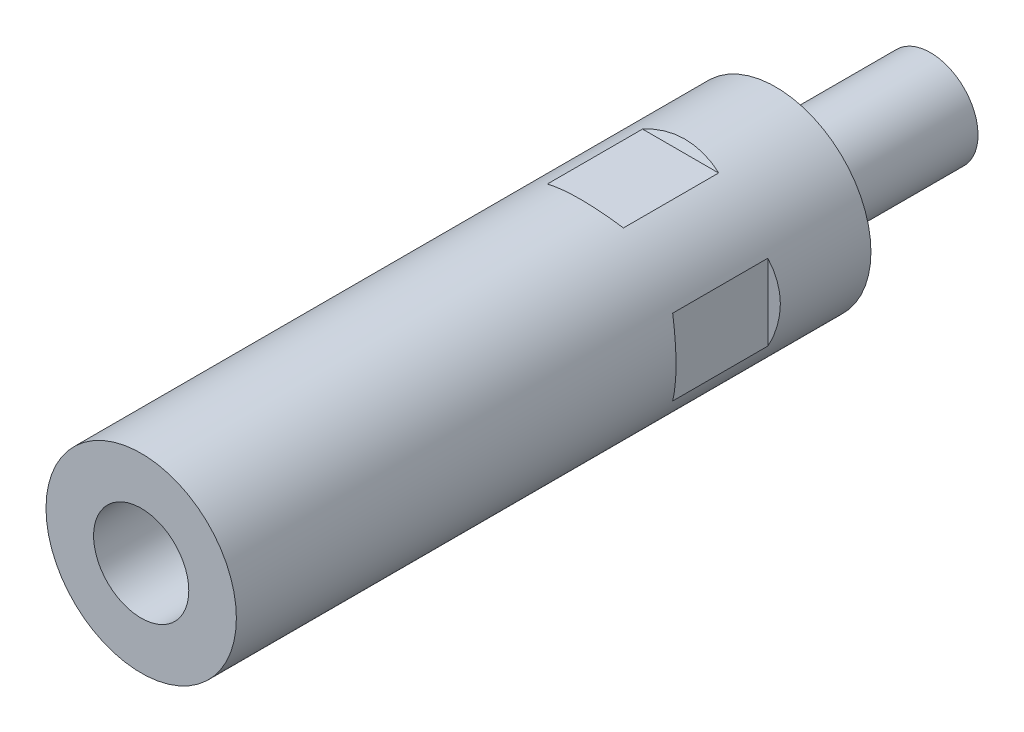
ISO-10303-21;
HEADER;
FILE_DESCRIPTION(('STEP AP214'),'2;1');
FILE_NAME('part.step','',(''),(''),'','','');
FILE_SCHEMA(('AUTOMOTIVE_DESIGN { 1 0 10303 214 1 1 1 1 }'));
ENDSEC;
DATA;
#1=APPLICATION_CONTEXT('core data for automotive mechanical design processes');
#2=APPLICATION_PROTOCOL_DEFINITION('international standard','automotive_design',2000,#1);
#3=PRODUCT_CONTEXT('',#1,'mechanical');
#4=PRODUCT('Part','Part','',(#3));
#5=PRODUCT_RELATED_PRODUCT_CATEGORY('part','',(#4));
#6=PRODUCT_DEFINITION_FORMATION('','',#4);
#7=PRODUCT_DEFINITION_CONTEXT('part definition',#1,'design');
#8=PRODUCT_DEFINITION('design','',#6,#7);
#9=PRODUCT_DEFINITION_SHAPE('','',#8);
#10=(LENGTH_UNIT() NAMED_UNIT(*) SI_UNIT(.MILLI.,.METRE.));
#11=(NAMED_UNIT(*) PLANE_ANGLE_UNIT() SI_UNIT($,.RADIAN.));
#12=(NAMED_UNIT(*) SI_UNIT($,.STERADIAN.) SOLID_ANGLE_UNIT());
#13=UNCERTAINTY_MEASURE_WITH_UNIT(LENGTH_MEASURE(1.E-05),#10,'distance_accuracy_value','');
#14=(GEOMETRIC_REPRESENTATION_CONTEXT(3) GLOBAL_UNCERTAINTY_ASSIGNED_CONTEXT((#13)) GLOBAL_UNIT_ASSIGNED_CONTEXT((#10,
#11,#12)) REPRESENTATION_CONTEXT('',''));
#15=CARTESIAN_POINT('',(0.,0.,0.));
#16=DIRECTION('',(0.,0.,1.));
#17=DIRECTION('',(1.,0.,0.));
#18=AXIS2_PLACEMENT_3D('',#15,#16,#17);
#19=CARTESIAN_POINT('',(0.,0.,0.5));
#20=DIRECTION('',(0.,0.,1.));
#21=DIRECTION('',(0.,-1.,0.));
#22=AXIS2_PLACEMENT_3D('',#19,#20,#21);
#23=CYLINDRICAL_SURFACE('',#22,6.);
#24=CARTESIAN_POINT('',(0.,0.,-19.5));
#25=DIRECTION('',(0.,0.,1.));
#26=DIRECTION('',(0.,-1.,0.));
#27=AXIS2_PLACEMENT_3D('',#24,#25,#26);
#28=CIRCLE('',#27,6.);
#29=CARTESIAN_POINT('',(0.,-6.,-19.5));
#30=VERTEX_POINT('',#29);
#31=EDGE_CURVE('E22',#30,#30,#28,.F.);
#32=ORIENTED_EDGE('',*,*,#31,.F.);
#33=EDGE_LOOP('',(#32));
#34=FACE_BOUND('',#33,.T.);
#35=CARTESIAN_POINT('',(0.,0.,0.));
#36=DIRECTION('',(0.,0.,1.));
#37=DIRECTION('',(1.,0.,0.));
#38=AXIS2_PLACEMENT_3D('',#35,#36,#37);
#39=CIRCLE('',#38,6.);
#40=CARTESIAN_POINT('',(6.,0.,0.));
#41=VERTEX_POINT('',#40);
#42=EDGE_CURVE('E9',#41,#41,#39,.T.);
#43=ORIENTED_EDGE('',*,*,#42,.F.);
#44=EDGE_LOOP('',(#43));
#45=FACE_BOUND('',#44,.T.);
#46=ADVANCED_FACE('F14',(#34,#45),#23,.T.);
#47=CARTESIAN_POINT('',(0.,0.,-19.5));
#48=DIRECTION('',(0.,0.,1.));
#49=DIRECTION('',(0.,-1.,0.));
#50=AXIS2_PLACEMENT_3D('',#47,#48,#49);
#51=PLANE('',#50);
#52=ORIENTED_EDGE('',*,*,#31,.T.);
#53=EDGE_LOOP('',(#52));
#54=FACE_BOUND('',#53,.T.);
#55=ADVANCED_FACE('F16',(#54),#51,.F.);
#56=CARTESIAN_POINT('',(5.1,0.,50.));
#57=DIRECTION('',(0.,0.,-1.));
#58=DIRECTION('',(-1.,0.,0.));
#59=AXIS2_PLACEMENT_3D('',#56,#57,#58);
#60=PLANE('',#59);
#61=CARTESIAN_POINT('',(0.,0.,50.));
#62=DIRECTION('',(0.,0.,1.));
#63=DIRECTION('',(1.,0.,0.));
#64=AXIS2_PLACEMENT_3D('',#61,#62,#63);
#65=CIRCLE('',#64,6.);
#66=CARTESIAN_POINT('',(6.,0.,50.));
#67=VERTEX_POINT('',#66);
#68=EDGE_CURVE('E251',#67,#67,#65,.T.);
#69=ORIENTED_EDGE('',*,*,#68,.T.);
#70=EDGE_LOOP('',(#69));
#71=FACE_BOUND('',#70,.T.);
#72=ADVANCED_FACE('F125',(#71),#60,.F.);
#73=CARTESIAN_POINT('',(0.,0.,80.));
#74=DIRECTION('',(0.,0.,1.));
#75=DIRECTION('',(1.,0.,0.));
#76=AXIS2_PLACEMENT_3D('',#73,#74,#75);
#77=CYLINDRICAL_SURFACE('',#76,6.);
#78=ORIENTED_EDGE('',*,*,#68,.F.);
#79=EDGE_LOOP('',(#78));
#80=FACE_BOUND('',#79,.T.);
#81=CARTESIAN_POINT('',(0.,0.,80.));
#82=DIRECTION('',(0.,0.,1.));
#83=DIRECTION('',(1.,0.,0.));
#84=AXIS2_PLACEMENT_3D('',#81,#82,#83);
#85=CIRCLE('',#84,6.);
#86=CARTESIAN_POINT('',(6.,0.,80.));
#87=VERTEX_POINT('',#86);
#88=EDGE_CURVE('E96',#87,#87,#85,.T.);
#89=ORIENTED_EDGE('',*,*,#88,.T.);
#90=EDGE_LOOP('',(#89));
#91=FACE_BOUND('',#90,.T.);
#92=ADVANCED_FACE('F127',(#80,#91),#77,.F.);
#93=CARTESIAN_POINT('',(0.,0.,80.));
#94=DIRECTION('',(0.,0.,1.));
#95=DIRECTION('',(1.,0.,0.));
#96=AXIS2_PLACEMENT_3D('',#93,#94,#95);
#97=PLANE('',#96);
#98=ORIENTED_EDGE('',*,*,#88,.F.);
#99=EDGE_LOOP('',(#98));
#100=FACE_BOUND('',#99,.T.);
#101=CARTESIAN_POINT('',(0.,0.,80.));
#102=DIRECTION('',(0.,0.,1.));
#103=DIRECTION('',(1.,0.,0.));
#104=AXIS2_PLACEMENT_3D('',#101,#102,#103);
#105=CIRCLE('',#104,12.);
#106=CARTESIAN_POINT('',(12.,0.,80.));
#107=VERTEX_POINT('',#106);
#108=EDGE_CURVE('E239',#107,#107,#105,.T.);
#109=ORIENTED_EDGE('',*,*,#108,.T.);
#110=EDGE_LOOP('',(#109));
#111=FACE_BOUND('',#110,.T.);
#112=ADVANCED_FACE('F134',(#100,#111),#97,.T.);
#113=CARTESIAN_POINT('',(11.,-12.,24.));
#114=DIRECTION('',(-0.5,0.,0.866025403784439));
#115=DIRECTION('',(0.866025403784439,0.,0.5));
#116=AXIS2_PLACEMENT_3D('',#113,#114,#115);
#117=PLANE('',#116);
#118=DIRECTION('',(0.,1.,0.));
#119=VECTOR('',#118,1.);
#120=CARTESIAN_POINT('',(11.,-12.,24.));
#121=LINE('',#120,#119);
#122=CARTESIAN_POINT('',(11.,-4.79583152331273,24.));
#123=VERTEX_POINT('',#122);
#124=CARTESIAN_POINT('',(11.,4.79583152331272,24.));
#125=VERTEX_POINT('',#124);
#126=EDGE_CURVE('E183',#123,#125,#121,.T.);
#127=ORIENTED_EDGE('',*,*,#126,.T.);
#128=CARTESIAN_POINT('',(0.,0.,17.6491470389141));
#129=DIRECTION('',(-0.5,0.,0.866025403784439));
#130=DIRECTION('',(-0.866025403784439,0.,-0.5));
#131=AXIS2_PLACEMENT_3D('',#128,#129,#130);
#132=ELLIPSE('',#131,13.856406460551,12.);
#133=EDGE_CURVE('E35',#123,#125,#132,.T.);
#134=ORIENTED_EDGE('',*,*,#133,.F.);
#135=EDGE_LOOP('',(#127,#134));
#136=FACE_BOUND('',#135,.T.);
#137=ADVANCED_FACE('F175',(#136),#117,.F.);
#138=CARTESIAN_POINT('',(11.,-12.,24.));
#139=DIRECTION('',(-1.,0.,0.));
#140=DIRECTION('',(0.,0.,1.));
#141=AXIS2_PLACEMENT_3D('',#138,#139,#140);
#142=PLANE('',#141);
#143=ORIENTED_EDGE('',*,*,#126,.F.);
#144=DIRECTION('',(0.,0.,-1.));
#145=VECTOR('',#144,1.);
#146=CARTESIAN_POINT('',(11.,-4.79583152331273,80.));
#147=LINE('',#146,#145);
#148=CARTESIAN_POINT('',(11.,-4.79583152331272,12.));
#149=VERTEX_POINT('',#148);
#150=EDGE_CURVE('E191',#149,#123,#147,.F.);
#151=ORIENTED_EDGE('',*,*,#150,.F.);
#152=DIRECTION('',(0.,1.,0.));
#153=VECTOR('',#152,1.);
#154=CARTESIAN_POINT('',(11.,-12.,12.));
#155=LINE('',#154,#153);
#156=CARTESIAN_POINT('',(11.,4.79583152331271,12.));
#157=VERTEX_POINT('',#156);
#158=EDGE_CURVE('E187',#149,#157,#155,.T.);
#159=ORIENTED_EDGE('',*,*,#158,.T.);
#160=DIRECTION('',(0.,0.,-1.));
#161=VECTOR('',#160,1.);
#162=CARTESIAN_POINT('',(11.,4.79583152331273,80.));
#163=LINE('',#162,#161);
#164=EDGE_CURVE('E29',#125,#157,#163,.T.);
#165=ORIENTED_EDGE('',*,*,#164,.F.);
#166=EDGE_LOOP('',(#143,#151,#159,#165));
#167=FACE_BOUND('',#166,.T.);
#168=ADVANCED_FACE('F172',(#167),#142,.F.);
#169=CARTESIAN_POINT('',(11.,-12.,12.));
#170=DIRECTION('',(-0.5,0.,-0.866025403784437));
#171=DIRECTION('',(-0.866025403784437,0.,0.5));
#172=AXIS2_PLACEMENT_3D('',#169,#170,#171);
#173=PLANE('',#172);
#174=CARTESIAN_POINT('',(0.,0.,18.350852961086));
#175=DIRECTION('',(-0.5,0.,-0.866025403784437));
#176=DIRECTION('',(0.866025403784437,0.,-0.5));
#177=AXIS2_PLACEMENT_3D('',#174,#175,#176);
#178=ELLIPSE('',#177,13.856406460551,12.);
#179=EDGE_CURVE('E195',#157,#149,#178,.T.);
#180=ORIENTED_EDGE('',*,*,#179,.F.);
#181=ORIENTED_EDGE('',*,*,#158,.F.);
#182=EDGE_LOOP('',(#180,#181));
#183=FACE_BOUND('',#182,.T.);
#184=ADVANCED_FACE('F167',(#183),#173,.F.);
#185=CARTESIAN_POINT('',(-11.,-12.,12.));
#186=DIRECTION('',(0.5,0.,-0.866025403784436));
#187=DIRECTION('',(-0.866025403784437,0.,-0.5));
#188=AXIS2_PLACEMENT_3D('',#185,#186,#187);
#189=PLANE('',#188);
#190=CARTESIAN_POINT('',(0.,0.,18.350852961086));
#191=DIRECTION('',(0.5,0.,-0.866025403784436));
#192=DIRECTION('',(-0.866025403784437,0.,-0.5));
#193=AXIS2_PLACEMENT_3D('',#190,#191,#192);
#194=ELLIPSE('',#193,13.8564064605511,12.);
#195=CARTESIAN_POINT('',(-11.,-4.79583152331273,12.));
#196=VERTEX_POINT('',#195);
#197=CARTESIAN_POINT('',(-11.,4.79583152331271,12.));
#198=VERTEX_POINT('',#197);
#199=EDGE_CURVE('E193',#196,#198,#194,.T.);
#200=ORIENTED_EDGE('',*,*,#199,.F.);
#201=DIRECTION('',(0.,1.,0.));
#202=VECTOR('',#201,1.);
#203=CARTESIAN_POINT('',(-11.,-12.,12.));
#204=LINE('',#203,#202);
#205=EDGE_CURVE('E227',#196,#198,#204,.T.);
#206=ORIENTED_EDGE('',*,*,#205,.T.);
#207=EDGE_LOOP('',(#200,#206));
#208=FACE_BOUND('',#207,.T.);
#209=ADVANCED_FACE('F163',(#208),#189,.F.);
#210=CARTESIAN_POINT('',(-11.,-12.,24.));
#211=DIRECTION('',(0.5,0.,0.866025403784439));
#212=DIRECTION('',(0.866025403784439,0.,-0.5));
#213=AXIS2_PLACEMENT_3D('',#210,#211,#212);
#214=PLANE('',#213);
#215=DIRECTION('',(0.,1.,0.));
#216=VECTOR('',#215,1.);
#217=CARTESIAN_POINT('',(-11.,-12.,24.));
#218=LINE('',#217,#216);
#219=CARTESIAN_POINT('',(-11.,-4.79583152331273,24.));
#220=VERTEX_POINT('',#219);
#221=CARTESIAN_POINT('',(-11.,4.79583152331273,24.));
#222=VERTEX_POINT('',#221);
#223=EDGE_CURVE('E231',#220,#222,#218,.T.);
#224=ORIENTED_EDGE('',*,*,#223,.F.);
#225=CARTESIAN_POINT('',(0.,0.,17.6491470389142));
#226=DIRECTION('',(0.5,0.,0.866025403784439));
#227=DIRECTION('',(0.866025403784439,0.,-0.5));
#228=AXIS2_PLACEMENT_3D('',#225,#226,#227);
#229=ELLIPSE('',#228,13.856406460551,12.);
#230=EDGE_CURVE('E206',#222,#220,#229,.T.);
#231=ORIENTED_EDGE('',*,*,#230,.F.);
#232=EDGE_LOOP('',(#224,#231));
#233=FACE_BOUND('',#232,.T.);
#234=ADVANCED_FACE('F160',(#233),#214,.F.);
#235=CARTESIAN_POINT('',(-11.,-12.,24.));
#236=DIRECTION('',(1.,0.,0.));
#237=DIRECTION('',(0.,0.,-1.));
#238=AXIS2_PLACEMENT_3D('',#235,#236,#237);
#239=PLANE('',#238);
#240=ORIENTED_EDGE('',*,*,#223,.T.);
#241=DIRECTION('',(0.,0.,-1.));
#242=VECTOR('',#241,1.);
#243=CARTESIAN_POINT('',(-11.,4.79583152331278,80.));
#244=LINE('',#243,#242);
#245=EDGE_CURVE('E200',#198,#222,#244,.F.);
#246=ORIENTED_EDGE('',*,*,#245,.F.);
#247=ORIENTED_EDGE('',*,*,#205,.F.);
#248=DIRECTION('',(0.,0.,-1.));
#249=VECTOR('',#248,1.);
#250=CARTESIAN_POINT('',(-11.,-4.79583152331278,80.));
#251=LINE('',#250,#249);
#252=EDGE_CURVE('E203',#220,#196,#251,.T.);
#253=ORIENTED_EDGE('',*,*,#252,.F.);
#254=EDGE_LOOP('',(#240,#246,#247,#253));
#255=FACE_BOUND('',#254,.T.);
#256=ADVANCED_FACE('F158',(#255),#239,.F.);
#257=CARTESIAN_POINT('',(12.,11.,24.));
#258=DIRECTION('',(0.,-0.5,0.866025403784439));
#259=DIRECTION('',(0.,-0.866025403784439,-0.5));
#260=AXIS2_PLACEMENT_3D('',#257,#258,#259);
#261=PLANE('',#260);
#262=DIRECTION('',(-1.,0.,0.));
#263=VECTOR('',#262,1.);
#264=CARTESIAN_POINT('',(12.,11.,24.));
#265=LINE('',#264,#263);
#266=CARTESIAN_POINT('',(4.79583152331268,11.,24.));
#267=VERTEX_POINT('',#266);
#268=CARTESIAN_POINT('',(-4.79583152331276,11.,24.));
#269=VERTEX_POINT('',#268);
#270=EDGE_CURVE('E225',#267,#269,#265,.T.);
#271=ORIENTED_EDGE('',*,*,#270,.T.);
#272=CARTESIAN_POINT('',(0.,0.,17.6491470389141));
#273=DIRECTION('',(0.,-0.5,0.866025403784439));
#274=DIRECTION('',(0.,-0.866025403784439,-0.5));
#275=AXIS2_PLACEMENT_3D('',#272,#273,#274);
#276=ELLIPSE('',#275,13.856406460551,12.);
#277=EDGE_CURVE('E214',#267,#269,#276,.T.);
#278=ORIENTED_EDGE('',*,*,#277,.F.);
#279=EDGE_LOOP('',(#271,#278));
#280=FACE_BOUND('',#279,.T.);
#281=ADVANCED_FACE('F151',(#280),#261,.F.);
#282=CARTESIAN_POINT('',(12.,11.,24.));
#283=DIRECTION('',(0.,-1.,0.));
#284=DIRECTION('',(1.,0.,0.));
#285=AXIS2_PLACEMENT_3D('',#282,#283,#284);
#286=PLANE('',#285);
#287=ORIENTED_EDGE('',*,*,#270,.F.);
#288=DIRECTION('',(0.,0.,-1.));
#289=VECTOR('',#288,1.);
#290=CARTESIAN_POINT('',(4.79583152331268,11.,80.));
#291=LINE('',#290,#289);
#292=CARTESIAN_POINT('',(4.79583152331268,11.,12.));
#293=VERTEX_POINT('',#292);
#294=EDGE_CURVE('E88',#293,#267,#291,.F.);
#295=ORIENTED_EDGE('',*,*,#294,.F.);
#296=DIRECTION('',(-1.,0.,0.));
#297=VECTOR('',#296,1.);
#298=CARTESIAN_POINT('',(12.,11.,12.));
#299=LINE('',#298,#297);
#300=CARTESIAN_POINT('',(-4.79583152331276,11.,12.));
#301=VERTEX_POINT('',#300);
#302=EDGE_CURVE('E223',#293,#301,#299,.T.);
#303=ORIENTED_EDGE('',*,*,#302,.T.);
#304=DIRECTION('',(0.,0.,-1.));
#305=VECTOR('',#304,1.);
#306=CARTESIAN_POINT('',(-4.79583152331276,11.,80.));
#307=LINE('',#306,#305);
#308=EDGE_CURVE('E211',#269,#301,#307,.T.);
#309=ORIENTED_EDGE('',*,*,#308,.F.);
#310=EDGE_LOOP('',(#287,#295,#303,#309));
#311=FACE_BOUND('',#310,.T.);
#312=ADVANCED_FACE('F148',(#311),#286,.F.);
#313=CARTESIAN_POINT('',(12.,11.,12.));
#314=DIRECTION('',(0.,-0.5,-0.866025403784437));
#315=DIRECTION('',(0.,0.866025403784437,-0.5));
#316=AXIS2_PLACEMENT_3D('',#313,#314,#315);
#317=PLANE('',#316);
#318=CARTESIAN_POINT('',(0.,0.,18.350852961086));
#319=DIRECTION('',(0.,-0.5,-0.866025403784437));
#320=DIRECTION('',(0.,0.866025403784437,-0.5));
#321=AXIS2_PLACEMENT_3D('',#318,#319,#320);
#322=ELLIPSE('',#321,13.856406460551,12.);
#323=EDGE_CURVE('E209',#301,#293,#322,.T.);
#324=ORIENTED_EDGE('',*,*,#323,.F.);
#325=ORIENTED_EDGE('',*,*,#302,.F.);
#326=EDGE_LOOP('',(#324,#325));
#327=FACE_BOUND('',#326,.T.);
#328=ADVANCED_FACE('F145',(#327),#317,.F.);
#329=CARTESIAN_POINT('',(12.,-11.,12.));
#330=DIRECTION('',(0.,0.5,-0.866025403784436));
#331=DIRECTION('',(0.,0.866025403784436,0.5));
#332=AXIS2_PLACEMENT_3D('',#329,#330,#331);
#333=PLANE('',#332);
#334=CARTESIAN_POINT('',(0.,0.,18.350852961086));
#335=DIRECTION('',(0.,0.5,-0.866025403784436));
#336=DIRECTION('',(0.,-0.866025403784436,-0.5));
#337=AXIS2_PLACEMENT_3D('',#334,#335,#336);
#338=ELLIPSE('',#337,13.8564064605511,12.);
#339=CARTESIAN_POINT('',(4.79583152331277,-11.,12.));
#340=VERTEX_POINT('',#339);
#341=CARTESIAN_POINT('',(-4.79583152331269,-11.,12.));
#342=VERTEX_POINT('',#341);
#343=EDGE_CURVE('E79',#340,#342,#338,.T.);
#344=ORIENTED_EDGE('',*,*,#343,.F.);
#345=DIRECTION('',(-1.,0.,0.));
#346=VECTOR('',#345,1.);
#347=CARTESIAN_POINT('',(12.,-11.,12.));
#348=LINE('',#347,#346);
#349=EDGE_CURVE('E82',#340,#342,#348,.T.);
#350=ORIENTED_EDGE('',*,*,#349,.T.);
#351=EDGE_LOOP('',(#344,#350));
#352=FACE_BOUND('',#351,.T.);
#353=ADVANCED_FACE('F81',(#352),#333,.F.);
#354=CARTESIAN_POINT('',(12.,-11.,24.));
#355=DIRECTION('',(0.,0.5,0.866025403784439));
#356=DIRECTION('',(0.,-0.866025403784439,0.5));
#357=AXIS2_PLACEMENT_3D('',#354,#355,#356);
#358=PLANE('',#357);
#359=DIRECTION('',(-1.,0.,0.));
#360=VECTOR('',#359,1.);
#361=CARTESIAN_POINT('',(12.,-11.,24.));
#362=LINE('',#361,#360);
#363=CARTESIAN_POINT('',(4.79583152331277,-11.,24.));
#364=VERTEX_POINT('',#363);
#365=CARTESIAN_POINT('',(-4.79583152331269,-11.,24.));
#366=VERTEX_POINT('',#365);
#367=EDGE_CURVE('E95',#364,#366,#362,.T.);
#368=ORIENTED_EDGE('',*,*,#367,.F.);
#369=CARTESIAN_POINT('',(0.,0.,17.6491470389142));
#370=DIRECTION('',(0.,0.5,0.866025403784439));
#371=DIRECTION('',(0.,0.866025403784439,-0.5));
#372=AXIS2_PLACEMENT_3D('',#369,#370,#371);
#373=ELLIPSE('',#372,13.856406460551,12.);
#374=EDGE_CURVE('E101',#366,#364,#373,.T.);
#375=ORIENTED_EDGE('',*,*,#374,.F.);
#376=EDGE_LOOP('',(#368,#375));
#377=FACE_BOUND('',#376,.T.);
#378=ADVANCED_FACE('F139',(#377),#358,.F.);
#379=CARTESIAN_POINT('',(12.,-11.,24.));
#380=DIRECTION('',(0.,1.,0.));
#381=DIRECTION('',(-1.,0.,0.));
#382=AXIS2_PLACEMENT_3D('',#379,#380,#381);
#383=PLANE('',#382);
#384=ORIENTED_EDGE('',*,*,#367,.T.);
#385=DIRECTION('',(0.,0.,-1.));
#386=VECTOR('',#385,1.);
#387=CARTESIAN_POINT('',(-4.79583152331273,-11.,80.));
#388=LINE('',#387,#386);
#389=EDGE_CURVE('E87',#342,#366,#388,.F.);
#390=ORIENTED_EDGE('',*,*,#389,.F.);
#391=ORIENTED_EDGE('',*,*,#349,.F.);
#392=DIRECTION('',(0.,0.,-1.));
#393=VECTOR('',#392,1.);
#394=CARTESIAN_POINT('',(4.79583152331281,-11.,80.));
#395=LINE('',#394,#393);
#396=EDGE_CURVE('E93',#364,#340,#395,.T.);
#397=ORIENTED_EDGE('',*,*,#396,.F.);
#398=EDGE_LOOP('',(#384,#390,#391,#397));
#399=FACE_BOUND('',#398,.T.);
#400=ADVANCED_FACE('F92',(#399),#383,.F.);
#401=CARTESIAN_POINT('',(0.,0.,80.));
#402=DIRECTION('',(0.,0.,-1.));
#403=DIRECTION('',(-1.,0.,0.));
#404=AXIS2_PLACEMENT_3D('',#401,#402,#403);
#405=CYLINDRICAL_SURFACE('',#404,12.);
#406=ORIENTED_EDGE('',*,*,#389,.T.);
#407=ORIENTED_EDGE('',*,*,#374,.T.);
#408=ORIENTED_EDGE('',*,*,#396,.T.);
#409=ORIENTED_EDGE('',*,*,#343,.T.);
#410=EDGE_LOOP('',(#406,#407,#408,#409));
#411=FACE_BOUND('',#410,.T.);
#412=ORIENTED_EDGE('',*,*,#323,.T.);
#413=ORIENTED_EDGE('',*,*,#294,.T.);
#414=ORIENTED_EDGE('',*,*,#277,.T.);
#415=ORIENTED_EDGE('',*,*,#308,.T.);
#416=EDGE_LOOP('',(#412,#413,#414,#415));
#417=FACE_BOUND('',#416,.T.);
#418=ORIENTED_EDGE('',*,*,#245,.T.);
#419=ORIENTED_EDGE('',*,*,#230,.T.);
#420=ORIENTED_EDGE('',*,*,#252,.T.);
#421=ORIENTED_EDGE('',*,*,#199,.T.);
#422=EDGE_LOOP('',(#418,#419,#420,#421));
#423=FACE_BOUND('',#422,.T.);
#424=ORIENTED_EDGE('',*,*,#179,.T.);
#425=ORIENTED_EDGE('',*,*,#150,.T.);
#426=ORIENTED_EDGE('',*,*,#133,.T.);
#427=ORIENTED_EDGE('',*,*,#164,.T.);
#428=EDGE_LOOP('',(#424,#425,#426,#427));
#429=FACE_BOUND('',#428,.T.);
#430=ORIENTED_EDGE('',*,*,#108,.F.);
#431=EDGE_LOOP('',(#430));
#432=FACE_BOUND('',#431,.T.);
#433=CARTESIAN_POINT('',(0.,0.,0.));
#434=DIRECTION('',(0.,0.,1.));
#435=DIRECTION('',(1.,0.,0.));
#436=AXIS2_PLACEMENT_3D('',#433,#434,#435);
#437=CIRCLE('',#436,12.);
#438=CARTESIAN_POINT('',(12.,0.,0.));
#439=VERTEX_POINT('',#438);
#440=EDGE_CURVE('E186',#439,#439,#437,.T.);
#441=ORIENTED_EDGE('',*,*,#440,.T.);
#442=EDGE_LOOP('',(#441));
#443=FACE_BOUND('',#442,.T.);
#444=ADVANCED_FACE('F99',(#411,#417,#423,#429,#432,#443),#405,.T.);
#445=CARTESIAN_POINT('',(0.,0.,0.));
#446=DIRECTION('',(0.,0.,1.));
#447=DIRECTION('',(1.,0.,0.));
#448=AXIS2_PLACEMENT_3D('',#445,#446,#447);
#449=PLANE('',#448);
#450=ORIENTED_EDGE('',*,*,#440,.F.);
#451=EDGE_LOOP('',(#450));
#452=FACE_BOUND('',#451,.T.);
#453=ORIENTED_EDGE('',*,*,#42,.T.);
#454=EDGE_LOOP('',(#453));
#455=FACE_BOUND('',#454,.T.);
#456=ADVANCED_FACE('F111',(#452,#455),#449,.F.);
#457=CLOSED_SHELL('',(#46,#55,#72,#92,#112,#137,#168,#184,#209,#234,#256,#281,#312,#328,#353,
#378,#400,#444,#456));
#458=MANIFOLD_SOLID_BREP('B1',#457);
#459=ADVANCED_BREP_SHAPE_REPRESENTATION('',(#18,#458),#14);
#460=SHAPE_DEFINITION_REPRESENTATION(#9,#459);
ENDSEC;
END-ISO-10303-21;
